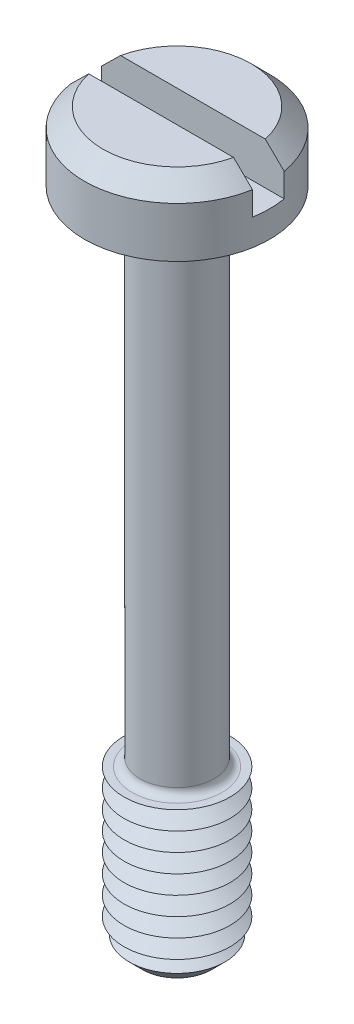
from build123d import *

# Parameters (mm, degrees)
SKETCH1_R           = 3.5
BOSS_EXTRUDE1_DEPTH = 2.6
SKETCH2_R           = 1.4
BOSS_EXTRUDE2_DEPTH = 25
SKETCH3_R           = 2
BOSS_EXTRUDE3_DEPTH = 6
CHAMFER1_SIZE       = 0.7
LPATTERN1_COUNT     = 8
LPATTERN1_PITCH     = 0.7
FILLET1_R           = 0.3
CHAMFER2_SIZE       = 0.7
SKETCH6_W           = 7
SKETCH6_H           = 1.2
CUT_EXTRUDE1_DEPTH  = 1.6


with BuildPart() as part:
    # Sketch1 → Boss-Extrude1 (new body)
    with BuildSketch(Plane(origin=(0, 0, 0), x_dir=(1, 0, 0), z_dir=(0, 1, 0))):
        with Locations(Location((0, 0, 0), (0, 0, 270))):
            Circle(SKETCH1_R)
    extrude(amount=BOSS_EXTRUDE1_DEPTH)

    # Sketch2 → Boss-Extrude2 (add)
    with BuildSketch(Plane.XZ):
        with Locations(Location((0, 0, 0), (0, 0, 270))):
            Circle(SKETCH2_R)
    extrude(amount=BOSS_EXTRUDE2_DEPTH)

    # Sketch3 → Boss-Extrude3 (add)
    with BuildSketch(Plane.XZ.offset(25)):
        with Locations(Location((0, 0, 0), (0, 0, 270))):
            Circle(SKETCH3_R)
    extrude(amount=-BOSS_EXTRUDE3_DEPTH)

    # Chamfer1
    chamfer1_edges = [part.edges().sort_by_distance(p)[0] for p in [
        (0, -25, 2),
    ]]
    chamfer(chamfer1_edges, length=CHAMFER1_SIZE)

    # Sketch5 → Cut-Revolve1 (revolve, cut)
    with BuildSketch(Plane(origin=(0, 0, 0), x_dir=(0, 0, -1), z_dir=(1, 0, 0))):
        Polygon((-2, -19), (-1.393782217, -19.35), (-2, -19.7), align=None)
    cut_revolve1 = revolve(axis=Axis((0, -6.58711856, 0), (0, -1, 0)), mode=Mode.SUBTRACT)

    # LPattern1: Cut-Revolve1 ×8
    with Locations(*[(0, -i * LPATTERN1_PITCH, 0) for i in range(1, LPATTERN1_COUNT)]):
        add(cut_revolve1, mode=Mode.SUBTRACT)

    # Fillet1
    fillet1_edges = [part.edges().sort_by_distance(p)[0] for p in [
        (0, 0, 1.4),
        (0, -19, 1.4),
    ]]
    fillet(fillet1_edges, radius=FILLET1_R)

    # Chamfer2
    chamfer2_edges = [part.edges().sort_by_distance(p)[0] for p in [
        (0, 2.6, -3.5),
    ]]
    chamfer(chamfer2_edges, length=CHAMFER2_SIZE)

    # Sketch6 → Cut-Extrude1 (cut)
    with BuildSketch(Plane(origin=(0, 2.6, 0), x_dir=(1, 0, 0), z_dir=(0, 1, 0))):
        Rectangle(SKETCH6_W, SKETCH6_H)
    extrude(amount=-CUT_EXTRUDE1_DEPTH, mode=Mode.SUBTRACT)


solid = part.part
